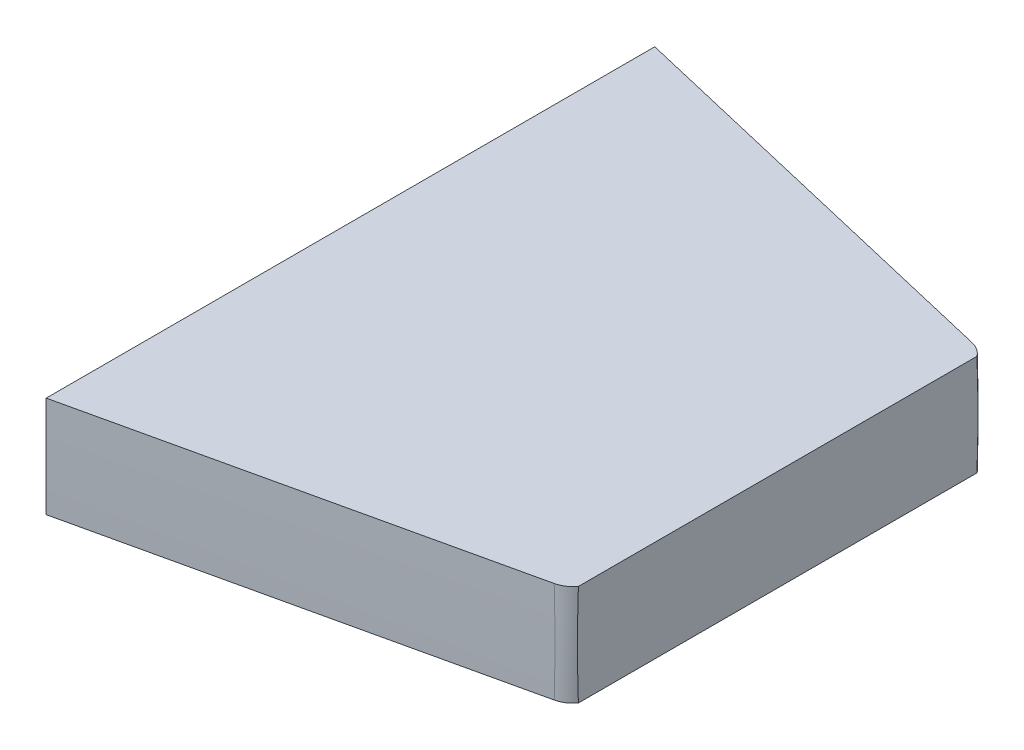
ISO-10303-21;
HEADER;
FILE_DESCRIPTION(('STEP AP214'),'2;1');
FILE_NAME('part.step','',(''),(''),'','','');
FILE_SCHEMA(('AUTOMOTIVE_DESIGN { 1 0 10303 214 1 1 1 1 }'));
ENDSEC;
DATA;
#1=APPLICATION_CONTEXT('core data for automotive mechanical design processes');
#2=APPLICATION_PROTOCOL_DEFINITION('international standard','automotive_design',2000,#1);
#3=PRODUCT_CONTEXT('',#1,'mechanical');
#4=PRODUCT('Part','Part','',(#3));
#5=PRODUCT_RELATED_PRODUCT_CATEGORY('part','',(#4));
#6=PRODUCT_DEFINITION_FORMATION('','',#4);
#7=PRODUCT_DEFINITION_CONTEXT('part definition',#1,'design');
#8=PRODUCT_DEFINITION('design','',#6,#7);
#9=PRODUCT_DEFINITION_SHAPE('','',#8);
#10=(LENGTH_UNIT() NAMED_UNIT(*) SI_UNIT(.MILLI.,.METRE.));
#11=(NAMED_UNIT(*) PLANE_ANGLE_UNIT() SI_UNIT($,.RADIAN.));
#12=(NAMED_UNIT(*) SI_UNIT($,.STERADIAN.) SOLID_ANGLE_UNIT());
#13=UNCERTAINTY_MEASURE_WITH_UNIT(LENGTH_MEASURE(1.E-05),#10,'distance_accuracy_value','');
#14=(GEOMETRIC_REPRESENTATION_CONTEXT(3) GLOBAL_UNCERTAINTY_ASSIGNED_CONTEXT((#13)) GLOBAL_UNIT_ASSIGNED_CONTEXT((#10,
#11,#12)) REPRESENTATION_CONTEXT('',''));
#15=CARTESIAN_POINT('',(0.,0.,0.));
#16=DIRECTION('',(0.,0.,1.));
#17=DIRECTION('',(1.,0.,0.));
#18=AXIS2_PLACEMENT_3D('',#15,#16,#17);
#19=CARTESIAN_POINT('',(1.63861979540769E-11,-5.18790739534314E-13,12.5584214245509));
#20=DIRECTION('',(0.,0.,-1.));
#21=DIRECTION('',(-1.,0.,0.));
#22=AXIS2_PLACEMENT_3D('',#19,#20,#21);
#23=CONICAL_SURFACE('',#22,33.2247053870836,1.34888360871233);
#24=CARTESIAN_POINT('',(33.2096529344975,-1.00000001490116,12.5584214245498));
#25=CARTESIAN_POINT('',(31.8413887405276,-1.00000001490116,12.8670076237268));
#26=CARTESIAN_POINT('',(30.4731189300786,-1.00000001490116,13.1755689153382));
#27=CARTESIAN_POINT('',(27.7365680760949,-1.00000001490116,13.7926416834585));
#28=CARTESIAN_POINT('',(26.3682870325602,-1.00000001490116,14.1011531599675));
#29=CARTESIAN_POINT('',(25.0000003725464,-1.00000001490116,14.4096397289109));
#30=B_SPLINE_CURVE_WITH_KNOTS('',3,(#24,#25,#26,#27,#28,#29),.UNSPECIFIED.,.F.,.F.,(4,2,4),(0.,
4.20789152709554,8.41578305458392),.UNSPECIFIED.);
#31=CARTESIAN_POINT('',(33.2096529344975,-1.00000001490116,12.5584214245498));
#32=VERTEX_POINT('',#31);
#33=CARTESIAN_POINT('',(25.0000003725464,-1.00000001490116,14.4096397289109));
#34=VERTEX_POINT('',#33);
#35=EDGE_CURVE('E73',#32,#34,#30,.T.);
#36=ORIENTED_EDGE('',*,*,#35,.F.);
#37=CARTESIAN_POINT('',(-7.17828574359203E-12,-7.0830927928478E-13,12.5584214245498));
#38=DIRECTION('',(0.,0.,-1.));
#39=DIRECTION('',(-1.,0.,0.));
#40=AXIS2_PLACEMENT_3D('',#37,#38,#39);
#41=CIRCLE('',#40,33.224705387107);
#42=CARTESIAN_POINT('',(33.2096529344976,1.00000001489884,12.5584214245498));
#43=VERTEX_POINT('',#42);
#44=EDGE_CURVE('E80',#43,#32,#41,.T.);
#45=ORIENTED_EDGE('',*,*,#44,.F.);
#46=CARTESIAN_POINT('',(25.0000003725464,1.00000001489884,14.4096397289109));
#47=CARTESIAN_POINT('',(26.3682870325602,1.00000001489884,14.1011531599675));
#48=CARTESIAN_POINT('',(27.7365680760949,1.00000001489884,13.7926416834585));
#49=CARTESIAN_POINT('',(30.4731189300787,1.00000001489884,13.1755689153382));
#50=CARTESIAN_POINT('',(31.8413887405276,1.00000001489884,12.8670076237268));
#51=CARTESIAN_POINT('',(33.2096529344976,1.00000001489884,12.5584214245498));
#52=B_SPLINE_CURVE_WITH_KNOTS('',3,(#46,#47,#48,#49,#50,#51),.UNSPECIFIED.,.F.,.F.,(4,2,4),(0.,
4.20789152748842,8.41578305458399),.UNSPECIFIED.);
#53=CARTESIAN_POINT('',(25.0000003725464,1.00000001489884,14.4096397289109));
#54=VERTEX_POINT('',#53);
#55=EDGE_CURVE('E76',#54,#43,#52,.T.);
#56=ORIENTED_EDGE('',*,*,#55,.F.);
#57=CARTESIAN_POINT('',(25.0000003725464,-1.00000001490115,14.4096397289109));
#58=CARTESIAN_POINT('',(25.0000003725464,-0.666666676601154,14.4126469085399));
#59=CARTESIAN_POINT('',(25.0000003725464,-0.333333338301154,14.4141504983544));
#60=CARTESIAN_POINT('',(25.0000003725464,0.333333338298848,14.4141504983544));
#61=CARTESIAN_POINT('',(25.0000003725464,0.666666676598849,14.4126469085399));
#62=CARTESIAN_POINT('',(25.0000003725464,1.00000001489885,14.4096397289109));
#63=B_SPLINE_CURVE_WITH_KNOTS('',3,(#57,#58,#59,#60,#61,#62),.UNSPECIFIED.,.F.,.F.,(4,2,4),(0.,
1.00001018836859,2.00002037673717),.UNSPECIFIED.);
#64=EDGE_CURVE('E21',#34,#54,#63,.T.);
#65=ORIENTED_EDGE('',*,*,#64,.F.);
#66=EDGE_LOOP('',(#36,#45,#56,#65));
#67=FACE_BOUND('',#66,.T.);
#68=ADVANCED_FACE('F16',(#67),#23,.T.);
#69=CARTESIAN_POINT('',(25.0000003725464,-1.01000001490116,2.33806122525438));
#70=DIRECTION('',(-1.,0.,0.));
#71=DIRECTION('',(0.,0.,1.));
#72=AXIS2_PLACEMENT_3D('',#69,#70,#71);
#73=PLANE('',#72);
#74=CARTESIAN_POINT('',(25.0000003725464,-1.00000001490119,2.35746474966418));
#75=CARTESIAN_POINT('',(25.000000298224,-0.916652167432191,2.35668095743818));
#76=CARTESIAN_POINT('',(25.0000001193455,-0.833303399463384,2.35599498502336));
#77=CARTESIAN_POINT('',(24.9999998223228,-0.666627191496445,2.35481907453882));
#78=CARTESIAN_POINT('',(24.9999997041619,-0.583299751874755,2.35432908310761));
#79=CARTESIAN_POINT('',(24.999999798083,-0.416649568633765,2.35354512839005));
#80=CARTESIAN_POINT('',(25.0000000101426,-0.333326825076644,2.35325115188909));
#81=CARTESIAN_POINT('',(25.0000005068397,-0.166669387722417,2.35285917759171));
#82=CARTESIAN_POINT('',(25.0000007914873,-0.0833346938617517,2.35276120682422));
#83=CARTESIAN_POINT('',(25.0000007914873,0.0833346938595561,2.35276120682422));
#84=CARTESIAN_POINT('',(25.0000005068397,0.166669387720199,2.35285917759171));
#85=CARTESIAN_POINT('',(25.0000000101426,0.333326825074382,2.35325115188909));
#86=CARTESIAN_POINT('',(24.999999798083,0.416649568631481,2.35354512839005));
#87=CARTESIAN_POINT('',(24.9999997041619,0.583299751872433,2.35432908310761));
#88=CARTESIAN_POINT('',(24.9999998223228,0.666627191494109,2.35481907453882));
#89=CARTESIAN_POINT('',(25.0000001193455,0.833303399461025,2.35599498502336));
#90=CARTESIAN_POINT('',(25.000000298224,0.916652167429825,2.35668095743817));
#91=CARTESIAN_POINT('',(25.0000003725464,1.00000001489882,2.35746474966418));
#92=B_SPLINE_CURVE_WITH_KNOTS('',3,(#74,#75,#76,#77,#78,#79,#80,#81,#82,#83,#84,#85,#86,#87,#88,
#89,#90,#91),.UNSPECIFIED.,.F.,.F.,(4,2,2,2,2,2,2,2,4),(0.,0.25005454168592,0.50004095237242,
0.750010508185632,1.00001453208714,1.25001855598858,1.49998811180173,1.74997452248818,
2.00002906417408),.UNSPECIFIED.);
#93=CARTESIAN_POINT('',(25.0000003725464,-1.00000001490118,2.35746474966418));
#94=VERTEX_POINT('',#93);
#95=CARTESIAN_POINT('',(25.0000003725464,1.00000001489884,2.35746474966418));
#96=VERTEX_POINT('',#95);
#97=EDGE_CURVE('E86',#94,#96,#92,.T.);
#98=ORIENTED_EDGE('',*,*,#97,.F.);
#99=DIRECTION('',(0.,0.,-1.));
#100=VECTOR('',#99,1.);
#101=CARTESIAN_POINT('',(25.0000003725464,-1.00000001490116,8.38355223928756));
#102=LINE('',#101,#100);
#103=EDGE_CURVE('E83',#34,#94,#102,.T.);
#104=ORIENTED_EDGE('',*,*,#103,.F.);
#105=ORIENTED_EDGE('',*,*,#64,.T.);
#106=DIRECTION('',(0.,0.,1.));
#107=VECTOR('',#106,1.);
#108=CARTESIAN_POINT('',(25.0000003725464,1.00000001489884,8.38355223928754));
#109=LINE('',#108,#107);
#110=EDGE_CURVE('E123',#96,#54,#109,.T.);
#111=ORIENTED_EDGE('',*,*,#110,.F.);
#112=EDGE_LOOP('',(#98,#104,#105,#111));
#113=FACE_BOUND('',#112,.T.);
#114=ADVANCED_FACE('F84',(#113),#73,.T.);
#115=CARTESIAN_POINT('',(1.27189925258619E-11,-7.28367019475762E-13,12.0706822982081));
#116=DIRECTION('',(0.,0.,-1.));
#117=DIRECTION('',(-1.,0.,0.));
#118=AXIS2_PLACEMENT_3D('',#115,#116,#117);
#119=TOROIDAL_SURFACE('',#118,33.1146574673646,0.499999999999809);
#120=CARTESIAN_POINT('',(33.5000003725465,-1.00000001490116,12.3703286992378));
#121=CARTESIAN_POINT('',(33.4829055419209,-1.00000001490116,12.3931883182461));
#122=CARTESIAN_POINT('',(33.4638278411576,-1.00000001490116,12.4145480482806));
#123=CARTESIAN_POINT('',(33.4229271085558,-1.00000001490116,12.4531581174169));
#124=CARTESIAN_POINT('',(33.4011991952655,-1.00000001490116,12.4705092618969));
#125=CARTESIAN_POINT('',(33.3530501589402,-1.00000001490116,12.5027839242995));
#126=CARTESIAN_POINT('',(33.326381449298,-1.00000001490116,12.5173395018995));
#127=CARTESIAN_POINT('',(33.2699629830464,-1.00000001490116,12.5418209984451));
#128=CARTESIAN_POINT('',(33.2401413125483,-1.00000001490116,12.5515812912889));
#129=CARTESIAN_POINT('',(33.2096529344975,-1.00000001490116,12.5584214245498));
#130=B_SPLINE_CURVE_WITH_KNOTS('',3,(#120,#121,#122,#123,#124,#125,#126,#127,#128,#129),
.UNSPECIFIED.,.F.,.F.,(4,2,2,2,4),(0.,0.0855072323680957,0.16854675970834,0.259192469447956,
0.352780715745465),.UNSPECIFIED.);
#131=CARTESIAN_POINT('',(33.5000003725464,-1.00000001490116,12.3703286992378));
#132=VERTEX_POINT('',#131);
#133=EDGE_CURVE('E94',#132,#32,#130,.T.);
#134=ORIENTED_EDGE('',*,*,#133,.F.);
#135=CARTESIAN_POINT('',(33.5000003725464,1.00000001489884,12.3703286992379));
#136=CARTESIAN_POINT('',(33.5000003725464,0.916692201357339,12.3736426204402));
#137=CARTESIAN_POINT('',(33.5000003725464,0.833366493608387,12.3764702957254));
#138=CARTESIAN_POINT('',(33.5000003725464,0.666691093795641,12.3812395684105));
#139=CARTESIAN_POINT('',(33.5000003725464,0.583341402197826,12.3831811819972));
#140=CARTESIAN_POINT('',(33.5000003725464,0.333330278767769,12.3878055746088));
#141=CARTESIAN_POINT('',(33.5000003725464,0.166646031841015,12.3892901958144));
#142=CARTESIAN_POINT('',(33.5000003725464,-0.166709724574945,12.3892897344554));
#143=CARTESIAN_POINT('',(33.5000003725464,-0.333381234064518,12.3878048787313));
#144=CARTESIAN_POINT('',(33.5000003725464,-0.58337324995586,12.3831804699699));
#145=CARTESIAN_POINT('',(33.5000003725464,-0.666716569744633,12.3812389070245));
#146=CARTESIAN_POINT('',(33.5000003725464,-0.83337922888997,12.3764698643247));
#147=CARTESIAN_POINT('',(33.5000003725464,-0.916698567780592,12.3736423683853));
#148=CARTESIAN_POINT('',(33.5000003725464,-1.00000001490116,12.3703286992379));
#149=B_SPLINE_CURVE_WITH_KNOTS('',3,(#135,#136,#137,#138,#139,#140,#141,#142,#143,#144,#145,
#146,#147,#148),.UNSPECIFIED.,.F.,.F.,(4,2,2,2,2,2,4),(0.,0.250117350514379,0.500230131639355,
1.00027329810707,1.50027826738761,1.75037193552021,2.00047017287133),.UNSPECIFIED.);
#150=CARTESIAN_POINT('',(33.5000003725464,1.00000001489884,12.3703286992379));
#151=VERTEX_POINT('',#150);
#152=EDGE_CURVE('E157',#151,#132,#149,.T.);
#153=ORIENTED_EDGE('',*,*,#152,.F.);
#154=CARTESIAN_POINT('',(33.2096529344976,1.00000001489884,12.5584214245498));
#155=CARTESIAN_POINT('',(33.2375087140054,1.00000001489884,12.5521604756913));
#156=CARTESIAN_POINT('',(33.2648065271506,1.00000001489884,12.5434777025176));
#157=CARTESIAN_POINT('',(33.3167735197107,1.00000001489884,12.5219270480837));
#158=CARTESIAN_POINT('',(33.3414958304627,1.00000001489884,12.5091872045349));
#159=CARTESIAN_POINT('',(33.3906323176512,1.00000001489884,12.4784366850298));
#160=CARTESIAN_POINT('',(33.4148130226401,1.00000001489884,12.4600514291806));
#161=CARTESIAN_POINT('',(33.4602082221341,1.00000001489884,12.4185769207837));
#162=CARTESIAN_POINT('',(33.4813009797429,1.00000001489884,12.395354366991));
#163=CARTESIAN_POINT('',(33.5000003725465,1.00000001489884,12.3703286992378));
#164=B_SPLINE_CURVE_WITH_KNOTS('',3,(#154,#155,#156,#157,#158,#159,#160,#161,#162,#163),
.UNSPECIFIED.,.F.,.F.,(4,2,2,2,4),(0.,0.0855261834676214,0.168583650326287,0.259211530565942,
0.352780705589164),.UNSPECIFIED.);
#165=EDGE_CURVE('E146',#43,#151,#164,.T.);
#166=ORIENTED_EDGE('',*,*,#165,.F.);
#167=ORIENTED_EDGE('',*,*,#44,.T.);
#168=EDGE_LOOP('',(#134,#153,#166,#167));
#169=FACE_BOUND('',#168,.T.);
#170=ADVANCED_FACE('F151',(#169),#119,.T.);
#171=CARTESIAN_POINT('',(33.5100003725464,-1.00000001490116,14.4196397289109));
#172=DIRECTION('',(0.,-1.,0.));
#173=DIRECTION('',(-1.,0.,0.));
#174=AXIS2_PLACEMENT_3D('',#171,#172,#173);
#175=PLANE('',#174);
#176=CARTESIAN_POINT('',(33.214118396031,-1.00000001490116,4.28888778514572));
#177=CARTESIAN_POINT('',(33.2419096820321,-1.00000001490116,4.29540152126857));
#178=CARTESIAN_POINT('',(33.2691218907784,-1.00000001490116,4.30433206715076));
#179=CARTESIAN_POINT('',(33.3208900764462,-1.00000001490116,4.32635652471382));
#180=CARTESIAN_POINT('',(33.3454996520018,-1.00000001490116,4.33932453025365));
#181=CARTESIAN_POINT('',(33.3937392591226,-1.00000001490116,4.37013124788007));
#182=CARTESIAN_POINT('',(33.4172034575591,-1.00000001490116,4.38823037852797));
#183=CARTESIAN_POINT('',(33.4612766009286,-1.00000001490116,4.42888576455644));
#184=CARTESIAN_POINT('',(33.4817734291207,-1.00000001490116,4.45156361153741));
#185=CARTESIAN_POINT('',(33.5000003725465,-1.00000001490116,4.47595192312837));
#186=B_SPLINE_CURVE_WITH_KNOTS('',3,(#176,#177,#178,#179,#180,#181,#182,#183,#184,#185),
.UNSPECIFIED.,.F.,.F.,(4,2,2,2,4),(0.,0.0855094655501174,0.168581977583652,0.257018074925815,
0.348217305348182),.UNSPECIFIED.);
#187=CARTESIAN_POINT('',(33.214118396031,-1.00000001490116,4.28888778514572));
#188=VERTEX_POINT('',#187);
#189=CARTESIAN_POINT('',(33.5000003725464,-1.00000001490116,4.47595192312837));
#190=VERTEX_POINT('',#189);
#191=EDGE_CURVE('E90',#188,#190,#186,.T.);
#192=ORIENTED_EDGE('',*,*,#191,.T.);
#193=DIRECTION('',(0.,0.,-1.));
#194=VECTOR('',#193,1.);
#195=CARTESIAN_POINT('',(33.5000003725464,-1.00000001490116,8.42314031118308));
#196=LINE('',#195,#194);
#197=EDGE_CURVE('E162',#132,#190,#196,.T.);
#198=ORIENTED_EDGE('',*,*,#197,.F.);
#199=ORIENTED_EDGE('',*,*,#133,.T.);
#200=ORIENTED_EDGE('',*,*,#35,.T.);
#201=ORIENTED_EDGE('',*,*,#103,.T.);
#202=CARTESIAN_POINT('',(33.214118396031,-1.00000001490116,4.28888778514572));
#203=CARTESIAN_POINT('',(31.8451108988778,-1.00000001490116,3.96693217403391));
#204=CARTESIAN_POINT('',(30.4760973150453,-1.00000001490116,3.64500244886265));
#205=CARTESIAN_POINT('',(27.7380579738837,-1.00000001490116,3.0011947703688));
#206=CARTESIAN_POINT('',(26.3690322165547,-1.00000001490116,2.67931681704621));
#207=CARTESIAN_POINT('',(25.0000003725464,-1.00000001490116,2.35746474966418));
#208=B_SPLINE_CURVE_WITH_KNOTS('',3,(#202,#203,#204,#205,#206,#207),.UNSPECIFIED.,.F.,.F.,(4,2,
4),(0.,4.21906772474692,8.43813544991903),.UNSPECIFIED.);
#209=EDGE_CURVE('E122',#188,#94,#208,.T.);
#210=ORIENTED_EDGE('',*,*,#209,.F.);
#211=EDGE_LOOP('',(#192,#198,#199,#200,#201,#210));
#212=FACE_BOUND('',#211,.T.);
#213=ADVANCED_FACE('F92',(#212),#175,.T.);
#214=CARTESIAN_POINT('',(24.9900003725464,1.00000001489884,14.4196397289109));
#215=DIRECTION('',(0.,1.,0.));
#216=DIRECTION('',(1.,0.,0.));
#217=AXIS2_PLACEMENT_3D('',#214,#215,#216);
#218=PLANE('',#217);
#219=ORIENTED_EDGE('',*,*,#110,.T.);
#220=ORIENTED_EDGE('',*,*,#55,.T.);
#221=ORIENTED_EDGE('',*,*,#165,.T.);
#222=DIRECTION('',(0.,0.,1.));
#223=VECTOR('',#222,1.);
#224=CARTESIAN_POINT('',(33.5000003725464,1.00000001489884,8.42314031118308));
#225=LINE('',#224,#223);
#226=CARTESIAN_POINT('',(33.5000003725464,1.00000001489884,4.4759519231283));
#227=VERTEX_POINT('',#226);
#228=EDGE_CURVE('E181',#227,#151,#225,.T.);
#229=ORIENTED_EDGE('',*,*,#228,.F.);
#230=CARTESIAN_POINT('',(33.5000003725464,1.00000001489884,4.47595192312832));
#231=CARTESIAN_POINT('',(33.482909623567,1.00000001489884,4.45309675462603));
#232=CARTESIAN_POINT('',(33.4638353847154,1.00000001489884,4.43174062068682));
#233=CARTESIAN_POINT('',(33.4229350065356,1.00000001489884,4.39312906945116));
#234=CARTESIAN_POINT('',(33.4012027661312,1.00000001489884,4.37577414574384));
#235=CARTESIAN_POINT('',(33.3536588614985,1.00000001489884,4.34390429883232));
#236=CARTESIAN_POINT('',(33.3276738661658,1.00000001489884,4.32964724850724));
#237=CARTESIAN_POINT('',(33.272762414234,1.00000001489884,4.30553385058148));
#238=CARTESIAN_POINT('',(33.2437694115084,1.00000001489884,4.2958289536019));
#239=CARTESIAN_POINT('',(33.2141183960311,1.00000001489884,4.28888778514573));
#240=B_SPLINE_CURVE_WITH_KNOTS('',3,(#230,#231,#232,#233,#234,#235,#236,#237,#238,#239),
.UNSPECIFIED.,.F.,.F.,(4,2,2,2,4),(0.,0.0854913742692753,0.168546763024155,0.256999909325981,
0.348217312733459),.UNSPECIFIED.);
#241=CARTESIAN_POINT('',(33.2141183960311,1.00000001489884,4.28888778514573));
#242=VERTEX_POINT('',#241);
#243=EDGE_CURVE('E40',#227,#242,#240,.T.);
#244=ORIENTED_EDGE('',*,*,#243,.T.);
#245=CARTESIAN_POINT('',(25.0000003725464,1.00000001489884,2.35746474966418));
#246=CARTESIAN_POINT('',(26.3690322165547,1.00000001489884,2.67931681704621));
#247=CARTESIAN_POINT('',(27.7380579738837,1.00000001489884,3.0011947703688));
#248=CARTESIAN_POINT('',(30.4760973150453,1.00000001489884,3.64500244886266));
#249=CARTESIAN_POINT('',(31.8451108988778,1.00000001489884,3.96693217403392));
#250=CARTESIAN_POINT('',(33.2141183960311,1.00000001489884,4.28888778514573));
#251=B_SPLINE_CURVE_WITH_KNOTS('',3,(#245,#246,#247,#248,#249,#250),.UNSPECIFIED.,.F.,.F.,(4,2,
4),(0.,4.21906772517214,8.43813544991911),.UNSPECIFIED.);
#252=EDGE_CURVE('E140',#96,#242,#251,.T.);
#253=ORIENTED_EDGE('',*,*,#252,.F.);
#254=EDGE_LOOP('',(#219,#220,#221,#229,#244,#253));
#255=FACE_BOUND('',#254,.T.);
#256=ADVANCED_FACE('F132',(#255),#218,.T.);
#257=CARTESIAN_POINT('',(-8.30932544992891E-12,-1.0806243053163E-12,2.35119072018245));
#258=DIRECTION('',(0.,0.,1.));
#259=DIRECTION('',(1.,0.,0.));
#260=AXIS2_PLACEMENT_3D('',#257,#258,#259);
#261=CONICAL_SURFACE('',#260,24.9933257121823,1.33972273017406);
#262=ORIENTED_EDGE('',*,*,#252,.T.);
#263=CARTESIAN_POINT('',(5.56846235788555E-12,-7.18283939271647E-13,4.28888778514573));
#264=DIRECTION('',(0.,0.,1.));
#265=DIRECTION('',(1.,0.,0.));
#266=AXIS2_PLACEMENT_3D('',#263,#264,#265);
#267=CIRCLE('',#266,33.2291688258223);
#268=EDGE_CURVE('E32',#188,#242,#267,.T.);
#269=ORIENTED_EDGE('',*,*,#268,.F.);
#270=ORIENTED_EDGE('',*,*,#209,.T.);
#271=ORIENTED_EDGE('',*,*,#97,.T.);
#272=EDGE_LOOP('',(#262,#269,#270,#271));
#273=FACE_BOUND('',#272,.T.);
#274=ADVANCED_FACE('F135',(#273),#261,.T.);
#275=CARTESIAN_POINT('',(33.5000003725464,-1.01000001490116,12.3992899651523));
#276=DIRECTION('',(1.,0.,0.));
#277=DIRECTION('',(0.,0.,-1.));
#278=AXIS2_PLACEMENT_3D('',#275,#276,#277);
#279=PLANE('',#278);
#280=CARTESIAN_POINT('',(33.5000003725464,1.00000001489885,4.47595192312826));
#281=CARTESIAN_POINT('',(33.5000003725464,0.916692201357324,4.47263800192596));
#282=CARTESIAN_POINT('',(33.5000003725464,0.833366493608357,4.46981032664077));
#283=CARTESIAN_POINT('',(33.5000003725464,0.666691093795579,4.46504105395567));
#284=CARTESIAN_POINT('',(33.5000003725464,0.583341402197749,4.46309944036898));
#285=CARTESIAN_POINT('',(33.5000003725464,0.333330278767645,4.45847504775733));
#286=CARTESIAN_POINT('',(33.5000003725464,0.16664603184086,4.45699042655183));
#287=CARTESIAN_POINT('',(33.5000003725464,-0.1667097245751,4.45699088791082));
#288=CARTESIAN_POINT('',(33.5000003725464,-0.333381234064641,4.45847574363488));
#289=CARTESIAN_POINT('',(33.5000003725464,-0.583373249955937,4.46310015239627));
#290=CARTESIAN_POINT('',(33.5000003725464,-0.666716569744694,4.4650417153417));
#291=CARTESIAN_POINT('',(33.5000003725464,-0.83337922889,4.46981075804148));
#292=CARTESIAN_POINT('',(33.5000003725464,-0.916698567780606,4.47263825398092));
#293=CARTESIAN_POINT('',(33.5000003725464,-1.00000001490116,4.47595192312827));
#294=B_SPLINE_CURVE_WITH_KNOTS('',3,(#280,#281,#282,#283,#284,#285,#286,#287,#288,#289,#290,
#291,#292,#293),.UNSPECIFIED.,.F.,.F.,(4,2,2,2,2,2,4),(0.,0.250117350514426,0.500230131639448,
1.00027329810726,1.50027826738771,1.75037193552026,2.00047017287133),.UNSPECIFIED.);
#295=EDGE_CURVE('E11',#227,#190,#294,.T.);
#296=ORIENTED_EDGE('',*,*,#295,.F.);
#297=ORIENTED_EDGE('',*,*,#228,.T.);
#298=ORIENTED_EDGE('',*,*,#152,.T.);
#299=ORIENTED_EDGE('',*,*,#197,.T.);
#300=EDGE_LOOP('',(#296,#297,#298,#299));
#301=FACE_BOUND('',#300,.T.);
#302=ADVANCED_FACE('F167',(#301),#279,.T.);
#303=CARTESIAN_POINT('',(5.5649929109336E-12,-7.18175519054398E-13,4.77559832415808));
#304=DIRECTION('',(0.,0.,-1.));
#305=DIRECTION('',(-1.,0.,0.));
#306=AXIS2_PLACEMENT_3D('',#303,#304,#305);
#307=TOROIDAL_SURFACE('',#306,33.1146574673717,0.499999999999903);
#308=ORIENTED_EDGE('',*,*,#243,.F.);
#309=ORIENTED_EDGE('',*,*,#295,.T.);
#310=ORIENTED_EDGE('',*,*,#191,.F.);
#311=ORIENTED_EDGE('',*,*,#268,.T.);
#312=EDGE_LOOP('',(#308,#309,#310,#311));
#313=FACE_BOUND('',#312,.T.);
#314=ADVANCED_FACE('F18',(#313),#307,.T.);
#315=CLOSED_SHELL('',(#68,#114,#170,#213,#256,#274,#302,#314));
#316=MANIFOLD_SOLID_BREP('B1',#315);
#317=ADVANCED_BREP_SHAPE_REPRESENTATION('',(#18,#316),#14);
#318=SHAPE_DEFINITION_REPRESENTATION(#9,#317);
ENDSEC;
END-ISO-10303-21;
